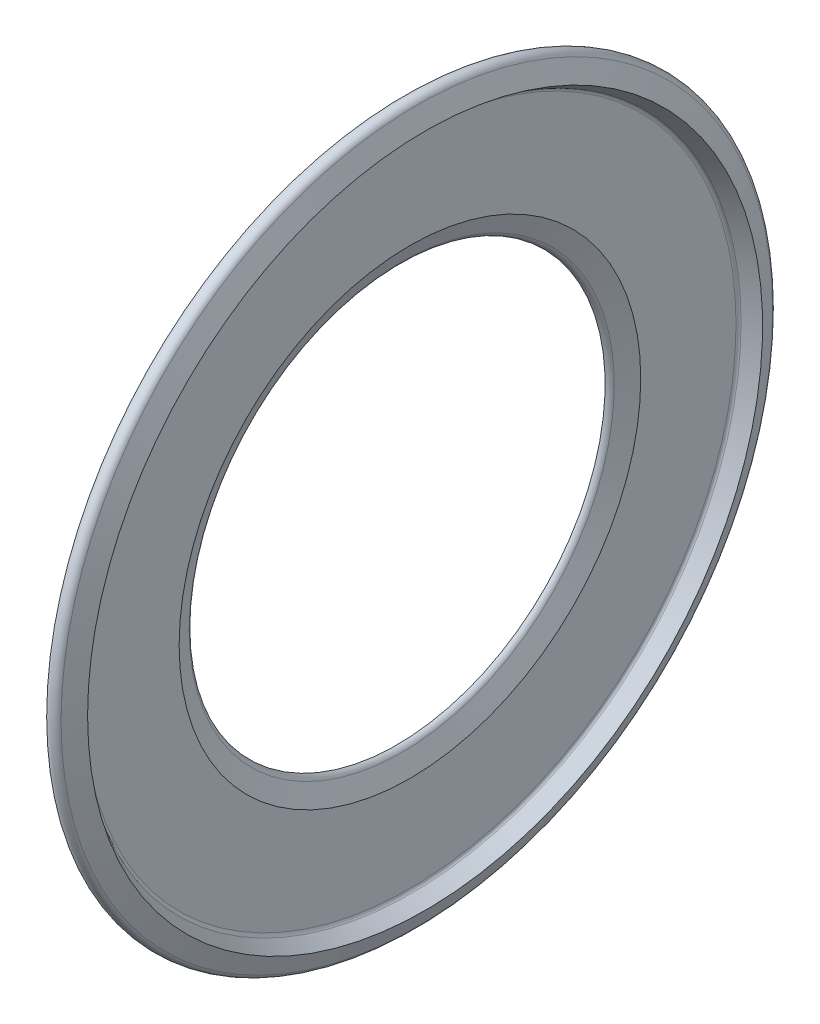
from build123d import *


with BuildPart() as part:
    # Esquisse1 → Base-R_volution (revolve)
    with BuildSketch(Plane.XY, mode=Mode.PRIVATE) as base_r_volution_sk:
        with BuildLine():
            Line((0.6, 6.09), (0.382287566, 5.607712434))
            ThreePointArc((0.382287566, 5.607712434), (0.329802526, 5.537844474), (0.252537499, 5.497023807))
            Line((0.252537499, 5.497023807), (0.252537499, 8.694030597))
            ThreePointArc((0.252537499, 8.694030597), (0.290597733, 8.885372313), (0.398984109, 9.047583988))
            Line((0.398984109, 9.047583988), (0.481799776, 9.130399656))
            Line((0.481799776, 9.130399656), (0.481799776, 9.466334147))
            ThreePointArc((0.481799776, 9.466334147), (0.65088111, 9.498419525), (0.782287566, 9.387287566))
            Line((0.782287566, 9.387287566), (1, 8.905))
            Line((1, 8.905), (0.647691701, 8.688772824))
            ThreePointArc((0.647691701, 8.688772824), (0.612733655, 8.652376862), (0.6, 8.603544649))
            Line((0.6, 8.603544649), (0.6, 6.09))
        make_face()
    revolve(base_r_volution_sk.sketch.rotate(Axis((-13, 0, 0), (1, 0, 0)), 90), axis=Axis((-13, 0, 0), (1, 0, 0)))


solid = part.part
